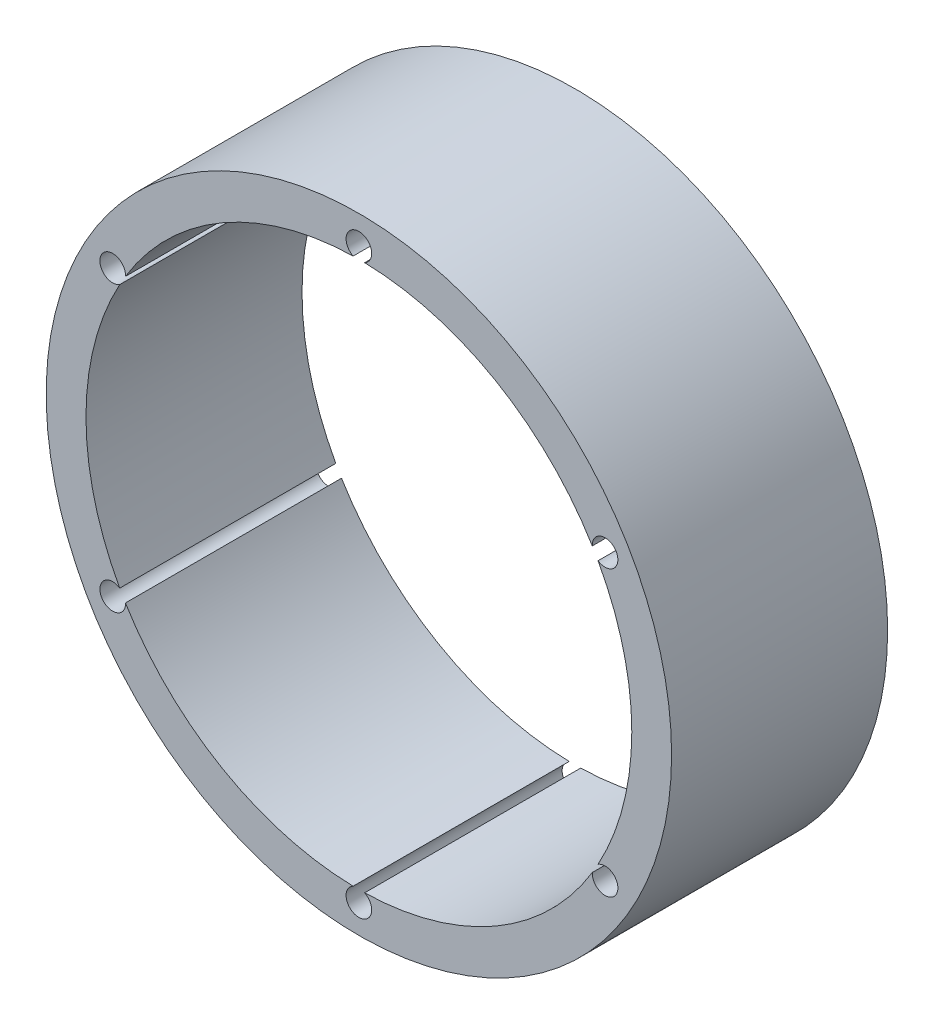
ISO-10303-21;
HEADER;
FILE_DESCRIPTION(('STEP AP214'),'2;1');
FILE_NAME('part.step','',(''),(''),'','','');
FILE_SCHEMA(('AUTOMOTIVE_DESIGN { 1 0 10303 214 1 1 1 1 }'));
ENDSEC;
DATA;
#1=APPLICATION_CONTEXT('core data for automotive mechanical design processes');
#2=APPLICATION_PROTOCOL_DEFINITION('international standard','automotive_design',2000,#1);
#3=PRODUCT_CONTEXT('',#1,'mechanical');
#4=PRODUCT('Part','Part','',(#3));
#5=PRODUCT_RELATED_PRODUCT_CATEGORY('part','',(#4));
#6=PRODUCT_DEFINITION_FORMATION('','',#4);
#7=PRODUCT_DEFINITION_CONTEXT('part definition',#1,'design');
#8=PRODUCT_DEFINITION('design','',#6,#7);
#9=PRODUCT_DEFINITION_SHAPE('','',#8);
#10=(LENGTH_UNIT() NAMED_UNIT(*) SI_UNIT(.MILLI.,.METRE.));
#11=(NAMED_UNIT(*) PLANE_ANGLE_UNIT() SI_UNIT($,.RADIAN.));
#12=(NAMED_UNIT(*) SI_UNIT($,.STERADIAN.) SOLID_ANGLE_UNIT());
#13=UNCERTAINTY_MEASURE_WITH_UNIT(LENGTH_MEASURE(1.E-05),#10,'distance_accuracy_value','');
#14=(GEOMETRIC_REPRESENTATION_CONTEXT(3) GLOBAL_UNCERTAINTY_ASSIGNED_CONTEXT((#13)) GLOBAL_UNIT_ASSIGNED_CONTEXT((#10,
#11,#12)) REPRESENTATION_CONTEXT('',''));
#15=CARTESIAN_POINT('',(0.,0.,0.));
#16=DIRECTION('',(0.,0.,1.));
#17=DIRECTION('',(1.,0.,0.));
#18=AXIS2_PLACEMENT_3D('',#15,#16,#17);
#19=CARTESIAN_POINT('',(0.,0.,0.));
#20=DIRECTION('',(0.,0.,1.));
#21=DIRECTION('',(1.,0.,0.));
#22=AXIS2_PLACEMENT_3D('',#19,#20,#21);
#23=PLANE('',#22);
#24=CARTESIAN_POINT('',(2.625132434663E-13,0.,0.));
#25=DIRECTION('',(0.,0.,1.));
#26=DIRECTION('',(1.,0.,0.));
#27=AXIS2_PLACEMENT_3D('',#24,#25,#26);
#28=CIRCLE('',#27,48.);
#29=CARTESIAN_POINT('',(41.055070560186,24.869281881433,0.));
#30=VERTEX_POINT('',#29);
#31=CARTESIAN_POINT('',(1.009894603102,47.989375,0.));
#32=VERTEX_POINT('',#31);
#33=EDGE_CURVE('E199',#30,#32,#28,.T.);
#34=ORIENTED_EDGE('',*,*,#33,.T.);
#35=CARTESIAN_POINT('',(0.,50.,0.));
#36=DIRECTION('',(0.,0.,1.));
#37=DIRECTION('',(0.448842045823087,-0.893611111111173,0.));
#38=AXIS2_PLACEMENT_3D('',#35,#36,#37);
#39=CIRCLE('',#38,2.25);
#40=CARTESIAN_POINT('',(-1.009894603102,47.989375,0.));
#41=VERTEX_POINT('',#40);
#42=EDGE_CURVE('E245',#32,#41,#39,.T.);
#43=ORIENTED_EDGE('',*,*,#42,.T.);
#44=CARTESIAN_POINT('',(2.625132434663E-13,0.,0.));
#45=DIRECTION('',(0.,0.,1.));
#46=DIRECTION('',(1.,0.,0.));
#47=AXIS2_PLACEMENT_3D('',#44,#45,#46);
#48=CIRCLE('',#47,48.);
#49=CARTESIAN_POINT('',(-41.05507056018,24.869281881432,0.));
#50=VERTEX_POINT('',#49);
#51=EDGE_CURVE('E244',#41,#50,#48,.T.);
#52=ORIENTED_EDGE('',*,*,#51,.T.);
#53=CARTESIAN_POINT('',(-43.30127018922,25.,0.));
#54=DIRECTION('',(0.,0.,1.));
#55=DIRECTION('',(0.998310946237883,-0.0580969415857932,0.));
#56=AXIS2_PLACEMENT_3D('',#53,#54,#55);
#57=CIRCLE('',#56,2.25);
#58=CARTESIAN_POINT('',(-42.06496516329,23.120093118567,0.));
#59=VERTEX_POINT('',#58);
#60=EDGE_CURVE('E255',#50,#59,#57,.T.);
#61=ORIENTED_EDGE('',*,*,#60,.T.);
#62=CARTESIAN_POINT('',(2.625132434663E-13,0.,0.));
#63=DIRECTION('',(0.,0.,1.));
#64=DIRECTION('',(1.,0.,0.));
#65=AXIS2_PLACEMENT_3D('',#62,#63,#64);
#66=CIRCLE('',#65,48.);
#67=CARTESIAN_POINT('',(-42.06496516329,-23.12009311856,0.));
#68=VERTEX_POINT('',#67);
#69=EDGE_CURVE('E256',#59,#68,#66,.T.);
#70=ORIENTED_EDGE('',*,*,#69,.T.);
#71=CARTESIAN_POINT('',(-43.30127018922,-25.,0.));
#72=DIRECTION('',(0.,0.,1.));
#73=DIRECTION('',(0.549468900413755,0.835514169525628,0.));
#74=AXIS2_PLACEMENT_3D('',#71,#72,#73);
#75=CIRCLE('',#74,2.25);
#76=CARTESIAN_POINT('',(-41.05507056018,-24.86928188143,0.));
#77=VERTEX_POINT('',#76);
#78=EDGE_CURVE('E106',#68,#77,#75,.T.);
#79=ORIENTED_EDGE('',*,*,#78,.T.);
#80=CARTESIAN_POINT('',(2.625132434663E-13,0.,0.));
#81=DIRECTION('',(0.,0.,1.));
#82=DIRECTION('',(1.,0.,0.));
#83=AXIS2_PLACEMENT_3D('',#80,#81,#82);
#84=CIRCLE('',#83,48.);
#85=CARTESIAN_POINT('',(-1.009894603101,-47.989375,0.));
#86=VERTEX_POINT('',#85);
#87=EDGE_CURVE('E105',#77,#86,#84,.T.);
#88=ORIENTED_EDGE('',*,*,#87,.T.);
#89=CARTESIAN_POINT('',(0.,-50.,0.));
#90=DIRECTION('',(0.,0.,1.));
#91=DIRECTION('',(-0.448842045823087,0.893611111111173,0.));
#92=AXIS2_PLACEMENT_3D('',#89,#90,#91);
#93=CIRCLE('',#92,2.25);
#94=CARTESIAN_POINT('',(1.009894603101,-47.989375,0.));
#95=VERTEX_POINT('',#94);
#96=EDGE_CURVE('E87',#86,#95,#93,.T.);
#97=ORIENTED_EDGE('',*,*,#96,.T.);
#98=CARTESIAN_POINT('',(2.625132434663E-13,0.,0.));
#99=DIRECTION('',(0.,0.,1.));
#100=DIRECTION('',(1.,0.,0.));
#101=AXIS2_PLACEMENT_3D('',#98,#99,#100);
#102=CIRCLE('',#101,48.);
#103=CARTESIAN_POINT('',(41.055070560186,-24.86928188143,0.));
#104=VERTEX_POINT('',#103);
#105=EDGE_CURVE('E127',#95,#104,#102,.T.);
#106=ORIENTED_EDGE('',*,*,#105,.T.);
#107=CARTESIAN_POINT('',(43.301270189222,-25.,0.));
#108=DIRECTION('',(0.,0.,1.));
#109=DIRECTION('',(-0.998310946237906,0.0580969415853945,0.));
#110=AXIS2_PLACEMENT_3D('',#107,#108,#109);
#111=CIRCLE('',#110,2.25);
#112=CARTESIAN_POINT('',(42.064965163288,-23.12009311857,0.));
#113=VERTEX_POINT('',#112);
#114=EDGE_CURVE('E25',#104,#113,#111,.T.);
#115=ORIENTED_EDGE('',*,*,#114,.T.);
#116=CARTESIAN_POINT('',(2.625132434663E-13,0.,0.));
#117=DIRECTION('',(0.,0.,1.));
#118=DIRECTION('',(0.876353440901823,-0.481668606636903,0.));
#119=AXIS2_PLACEMENT_3D('',#116,#117,#118);
#120=CIRCLE('',#119,48.);
#121=CARTESIAN_POINT('',(42.064965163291,23.120093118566,0.));
#122=VERTEX_POINT('',#121);
#123=EDGE_CURVE('E10',#113,#122,#120,.T.);
#124=ORIENTED_EDGE('',*,*,#123,.T.);
#125=CARTESIAN_POINT('',(43.301270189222,25.,0.));
#126=DIRECTION('',(0.,0.,1.));
#127=DIRECTION('',(-0.549468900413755,-0.835514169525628,0.));
#128=AXIS2_PLACEMENT_3D('',#125,#126,#127);
#129=CIRCLE('',#128,2.25);
#130=EDGE_CURVE('E210',#122,#30,#129,.T.);
#131=ORIENTED_EDGE('',*,*,#130,.T.);
#132=EDGE_LOOP('',(#34,#43,#52,#61,#70,#79,#88,#97,#106,#115,#124,#131));
#133=FACE_BOUND('',#132,.T.);
#134=CARTESIAN_POINT('',(0.,0.,0.));
#135=DIRECTION('',(0.,0.,1.));
#136=DIRECTION('',(1.,0.,0.));
#137=AXIS2_PLACEMENT_3D('',#134,#135,#136);
#138=CIRCLE('',#137,55.);
#139=CARTESIAN_POINT('',(55.,0.,0.));
#140=VERTEX_POINT('',#139);
#141=EDGE_CURVE('E325',#140,#140,#138,.T.);
#142=ORIENTED_EDGE('',*,*,#141,.F.);
#143=EDGE_LOOP('',(#142));
#144=FACE_BOUND('',#143,.T.);
#145=ADVANCED_FACE('F16',(#133,#144),#23,.F.);
#146=CARTESIAN_POINT('',(2.625132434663E-13,0.,0.));
#147=DIRECTION('',(0.,0.,-1.));
#148=DIRECTION('',(1.,0.,0.));
#149=AXIS2_PLACEMENT_3D('',#146,#147,#148);
#150=CYLINDRICAL_SURFACE('',#149,48.);
#151=ORIENTED_EDGE('',*,*,#123,.F.);
#152=DIRECTION('',(0.,0.,-1.));
#153=VECTOR('',#152,1.);
#154=CARTESIAN_POINT('',(42.064965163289,-23.12009311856,0.));
#155=LINE('',#154,#153);
#156=CARTESIAN_POINT('',(42.064965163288,-23.12009311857,38.));
#157=VERTEX_POINT('',#156);
#158=EDGE_CURVE('E135',#157,#113,#155,.T.);
#159=ORIENTED_EDGE('',*,*,#158,.F.);
#160=CARTESIAN_POINT('',(2.625132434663E-13,0.,38.));
#161=DIRECTION('',(0.,0.,-1.));
#162=DIRECTION('',(0.876353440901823,0.481668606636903,0.));
#163=AXIS2_PLACEMENT_3D('',#160,#161,#162);
#164=CIRCLE('',#163,48.);
#165=CARTESIAN_POINT('',(42.064965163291,23.120093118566,38.));
#166=VERTEX_POINT('',#165);
#167=EDGE_CURVE('E144',#166,#157,#164,.T.);
#168=ORIENTED_EDGE('',*,*,#167,.F.);
#169=DIRECTION('',(0.,0.,-1.));
#170=VECTOR('',#169,1.);
#171=CARTESIAN_POINT('',(42.064965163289,23.120093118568,0.));
#172=LINE('',#171,#170);
#173=EDGE_CURVE('E204',#166,#122,#172,.T.);
#174=ORIENTED_EDGE('',*,*,#173,.T.);
#175=EDGE_LOOP('',(#151,#159,#168,#174));
#176=FACE_BOUND('',#175,.T.);
#177=ADVANCED_FACE('F141',(#176),#150,.F.);
#178=CARTESIAN_POINT('',(43.301270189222,-25.,0.));
#179=DIRECTION('',(0.,0.,-1.));
#180=DIRECTION('',(1.,0.,0.));
#181=AXIS2_PLACEMENT_3D('',#178,#179,#180);
#182=CYLINDRICAL_SURFACE('',#181,2.25);
#183=CARTESIAN_POINT('',(43.301270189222,-25.,38.));
#184=DIRECTION('',(0.,0.,-1.));
#185=DIRECTION('',(-0.549468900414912,0.835514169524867,0.));
#186=AXIS2_PLACEMENT_3D('',#183,#184,#185);
#187=CIRCLE('',#186,2.25);
#188=CARTESIAN_POINT('',(41.055070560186,-24.86928188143,38.));
#189=VERTEX_POINT('',#188);
#190=EDGE_CURVE('E138',#157,#189,#187,.T.);
#191=ORIENTED_EDGE('',*,*,#190,.F.);
#192=ORIENTED_EDGE('',*,*,#158,.T.);
#193=ORIENTED_EDGE('',*,*,#114,.F.);
#194=DIRECTION('',(0.,0.,-1.));
#195=VECTOR('',#194,1.);
#196=CARTESIAN_POINT('',(41.055070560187,-24.86928188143,0.));
#197=LINE('',#196,#195);
#198=EDGE_CURVE('E97',#189,#104,#197,.T.);
#199=ORIENTED_EDGE('',*,*,#198,.F.);
#200=EDGE_LOOP('',(#191,#192,#193,#199));
#201=FACE_BOUND('',#200,.T.);
#202=ADVANCED_FACE('F18',(#201),#182,.F.);
#203=CARTESIAN_POINT('',(2.625132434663E-13,0.,0.));
#204=DIRECTION('',(0.,0.,-1.));
#205=DIRECTION('',(1.,0.,0.));
#206=AXIS2_PLACEMENT_3D('',#203,#204,#205);
#207=CYLINDRICAL_SURFACE('',#206,48.);
#208=ORIENTED_EDGE('',*,*,#198,.T.);
#209=ORIENTED_EDGE('',*,*,#105,.F.);
#210=DIRECTION('',(0.,0.,-1.));
#211=VECTOR('',#210,1.);
#212=CARTESIAN_POINT('',(1.009894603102,-47.989375,0.));
#213=LINE('',#212,#211);
#214=CARTESIAN_POINT('',(1.009894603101,-47.989375,38.));
#215=VERTEX_POINT('',#214);
#216=EDGE_CURVE('E96',#215,#95,#213,.T.);
#217=ORIENTED_EDGE('',*,*,#216,.F.);
#218=CARTESIAN_POINT('',(2.625132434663E-13,0.,38.));
#219=DIRECTION('',(0.,0.,1.));
#220=DIRECTION('',(1.,0.,0.));
#221=AXIS2_PLACEMENT_3D('',#218,#219,#220);
#222=CIRCLE('',#221,48.);
#223=EDGE_CURVE('E287',#215,#189,#222,.T.);
#224=ORIENTED_EDGE('',*,*,#223,.T.);
#225=EDGE_LOOP('',(#208,#209,#217,#224));
#226=FACE_BOUND('',#225,.T.);
#227=ADVANCED_FACE('F316',(#226),#207,.F.);
#228=CARTESIAN_POINT('',(0.,-50.,0.));
#229=DIRECTION('',(0.,0.,-1.));
#230=DIRECTION('',(1.,0.,0.));
#231=AXIS2_PLACEMENT_3D('',#228,#229,#230);
#232=CYLINDRICAL_SURFACE('',#231,2.25);
#233=CARTESIAN_POINT('',(0.,-50.,38.));
#234=DIRECTION('',(0.,0.,-1.));
#235=DIRECTION('',(0.448842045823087,0.893611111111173,0.));
#236=AXIS2_PLACEMENT_3D('',#233,#234,#235);
#237=CIRCLE('',#236,2.25);
#238=CARTESIAN_POINT('',(-1.009894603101,-47.989375,38.));
#239=VERTEX_POINT('',#238);
#240=EDGE_CURVE('E278',#215,#239,#237,.T.);
#241=ORIENTED_EDGE('',*,*,#240,.F.);
#242=ORIENTED_EDGE('',*,*,#216,.T.);
#243=ORIENTED_EDGE('',*,*,#96,.F.);
#244=DIRECTION('',(0.,0.,-1.));
#245=VECTOR('',#244,1.);
#246=CARTESIAN_POINT('',(-1.009894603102,-47.989375,0.));
#247=LINE('',#246,#245);
#248=EDGE_CURVE('E91',#239,#86,#247,.T.);
#249=ORIENTED_EDGE('',*,*,#248,.F.);
#250=EDGE_LOOP('',(#241,#242,#243,#249));
#251=FACE_BOUND('',#250,.T.);
#252=ADVANCED_FACE('F89',(#251),#232,.F.);
#253=CARTESIAN_POINT('',(2.625132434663E-13,0.,0.));
#254=DIRECTION('',(0.,0.,-1.));
#255=DIRECTION('',(1.,0.,0.));
#256=AXIS2_PLACEMENT_3D('',#253,#254,#255);
#257=CYLINDRICAL_SURFACE('',#256,48.);
#258=ORIENTED_EDGE('',*,*,#248,.T.);
#259=ORIENTED_EDGE('',*,*,#87,.F.);
#260=DIRECTION('',(0.,0.,-1.));
#261=VECTOR('',#260,1.);
#262=CARTESIAN_POINT('',(-41.05507056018,-24.86928188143,0.));
#263=LINE('',#262,#261);
#264=CARTESIAN_POINT('',(-41.05507056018,-24.86928188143,38.));
#265=VERTEX_POINT('',#264);
#266=EDGE_CURVE('E120',#265,#77,#263,.T.);
#267=ORIENTED_EDGE('',*,*,#266,.F.);
#268=CARTESIAN_POINT('',(2.625132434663E-13,0.,38.));
#269=DIRECTION('',(0.,0.,1.));
#270=DIRECTION('',(1.,0.,0.));
#271=AXIS2_PLACEMENT_3D('',#268,#269,#270);
#272=CIRCLE('',#271,48.);
#273=EDGE_CURVE('E111',#265,#239,#272,.T.);
#274=ORIENTED_EDGE('',*,*,#273,.T.);
#275=EDGE_LOOP('',(#258,#259,#267,#274));
#276=FACE_BOUND('',#275,.T.);
#277=ADVANCED_FACE('F115',(#276),#257,.F.);
#278=CARTESIAN_POINT('',(-43.30127018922,-25.,0.));
#279=DIRECTION('',(0.,0.,-1.));
#280=DIRECTION('',(1.,0.,0.));
#281=AXIS2_PLACEMENT_3D('',#278,#279,#280);
#282=CYLINDRICAL_SURFACE('',#281,2.25);
#283=CARTESIAN_POINT('',(-43.30127018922,-25.,38.));
#284=DIRECTION('',(0.,0.,-1.));
#285=DIRECTION('',(0.998310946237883,0.0580969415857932,0.));
#286=AXIS2_PLACEMENT_3D('',#283,#284,#285);
#287=CIRCLE('',#286,2.25);
#288=CARTESIAN_POINT('',(-42.06496516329,-23.12009311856,38.));
#289=VERTEX_POINT('',#288);
#290=EDGE_CURVE('E269',#265,#289,#287,.T.);
#291=ORIENTED_EDGE('',*,*,#290,.F.);
#292=ORIENTED_EDGE('',*,*,#266,.T.);
#293=ORIENTED_EDGE('',*,*,#78,.F.);
#294=DIRECTION('',(0.,0.,-1.));
#295=VECTOR('',#294,1.);
#296=CARTESIAN_POINT('',(-42.06496516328,-23.12009311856,0.));
#297=LINE('',#296,#295);
#298=EDGE_CURVE('E261',#289,#68,#297,.T.);
#299=ORIENTED_EDGE('',*,*,#298,.F.);
#300=EDGE_LOOP('',(#291,#292,#293,#299));
#301=FACE_BOUND('',#300,.T.);
#302=ADVANCED_FACE('F268',(#301),#282,.F.);
#303=CARTESIAN_POINT('',(2.625132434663E-13,0.,0.));
#304=DIRECTION('',(0.,0.,-1.));
#305=DIRECTION('',(1.,0.,0.));
#306=AXIS2_PLACEMENT_3D('',#303,#304,#305);
#307=CYLINDRICAL_SURFACE('',#306,48.);
#308=ORIENTED_EDGE('',*,*,#69,.F.);
#309=DIRECTION('',(0.,0.,-1.));
#310=VECTOR('',#309,1.);
#311=CARTESIAN_POINT('',(-42.06496516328,23.120093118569,0.));
#312=LINE('',#311,#310);
#313=CARTESIAN_POINT('',(-42.06496516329,23.120093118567,38.));
#314=VERTEX_POINT('',#313);
#315=EDGE_CURVE('E251',#314,#59,#312,.T.);
#316=ORIENTED_EDGE('',*,*,#315,.F.);
#317=CARTESIAN_POINT('',(2.625132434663E-13,0.,38.));
#318=DIRECTION('',(0.,0.,1.));
#319=DIRECTION('',(1.,0.,0.));
#320=AXIS2_PLACEMENT_3D('',#317,#318,#319);
#321=CIRCLE('',#320,48.);
#322=EDGE_CURVE('E274',#314,#289,#321,.T.);
#323=ORIENTED_EDGE('',*,*,#322,.T.);
#324=ORIENTED_EDGE('',*,*,#298,.T.);
#325=EDGE_LOOP('',(#308,#316,#323,#324));
#326=FACE_BOUND('',#325,.T.);
#327=ADVANCED_FACE('F341',(#326),#307,.F.);
#328=CARTESIAN_POINT('',(-43.30127018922,25.,0.));
#329=DIRECTION('',(0.,0.,-1.));
#330=DIRECTION('',(1.,0.,0.));
#331=AXIS2_PLACEMENT_3D('',#328,#329,#330);
#332=CYLINDRICAL_SURFACE('',#331,2.25);
#333=CARTESIAN_POINT('',(-43.30127018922,25.,38.));
#334=DIRECTION('',(0.,0.,-1.));
#335=DIRECTION('',(0.549468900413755,-0.835514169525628,0.));
#336=AXIS2_PLACEMENT_3D('',#333,#334,#335);
#337=CIRCLE('',#336,2.25);
#338=CARTESIAN_POINT('',(-41.05507056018,24.869281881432,38.));
#339=VERTEX_POINT('',#338);
#340=EDGE_CURVE('E223',#314,#339,#337,.T.);
#341=ORIENTED_EDGE('',*,*,#340,.F.);
#342=ORIENTED_EDGE('',*,*,#315,.T.);
#343=ORIENTED_EDGE('',*,*,#60,.F.);
#344=DIRECTION('',(0.,0.,-1.));
#345=VECTOR('',#344,1.);
#346=CARTESIAN_POINT('',(-41.05507056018,24.869281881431,0.));
#347=LINE('',#346,#345);
#348=EDGE_CURVE('E246',#339,#50,#347,.T.);
#349=ORIENTED_EDGE('',*,*,#348,.F.);
#350=EDGE_LOOP('',(#341,#342,#343,#349));
#351=FACE_BOUND('',#350,.T.);
#352=ADVANCED_FACE('F297',(#351),#332,.F.);
#353=CARTESIAN_POINT('',(2.625132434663E-13,0.,0.));
#354=DIRECTION('',(0.,0.,-1.));
#355=DIRECTION('',(1.,0.,0.));
#356=AXIS2_PLACEMENT_3D('',#353,#354,#355);
#357=CYLINDRICAL_SURFACE('',#356,48.);
#358=ORIENTED_EDGE('',*,*,#51,.F.);
#359=DIRECTION('',(0.,0.,-1.));
#360=VECTOR('',#359,1.);
#361=CARTESIAN_POINT('',(-1.009894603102,47.989375,0.));
#362=LINE('',#361,#360);
#363=CARTESIAN_POINT('',(-1.009894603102,47.989375,38.));
#364=VERTEX_POINT('',#363);
#365=EDGE_CURVE('E238',#364,#41,#362,.T.);
#366=ORIENTED_EDGE('',*,*,#365,.F.);
#367=CARTESIAN_POINT('',(2.625132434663E-13,0.,38.));
#368=DIRECTION('',(0.,0.,1.));
#369=DIRECTION('',(1.,0.,0.));
#370=AXIS2_PLACEMENT_3D('',#367,#368,#369);
#371=CIRCLE('',#370,48.);
#372=EDGE_CURVE('E227',#364,#339,#371,.T.);
#373=ORIENTED_EDGE('',*,*,#372,.T.);
#374=ORIENTED_EDGE('',*,*,#348,.T.);
#375=EDGE_LOOP('',(#358,#366,#373,#374));
#376=FACE_BOUND('',#375,.T.);
#377=ADVANCED_FACE('F299',(#376),#357,.F.);
#378=CARTESIAN_POINT('',(0.,50.,0.));
#379=DIRECTION('',(0.,0.,-1.));
#380=DIRECTION('',(1.,0.,0.));
#381=AXIS2_PLACEMENT_3D('',#378,#379,#380);
#382=CYLINDRICAL_SURFACE('',#381,2.25);
#383=CARTESIAN_POINT('',(0.,50.,38.));
#384=DIRECTION('',(0.,0.,-1.));
#385=DIRECTION('',(-0.448842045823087,-0.893611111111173,0.));
#386=AXIS2_PLACEMENT_3D('',#383,#384,#385);
#387=CIRCLE('',#386,2.25);
#388=CARTESIAN_POINT('',(1.009894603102,47.989375,38.));
#389=VERTEX_POINT('',#388);
#390=EDGE_CURVE('E230',#364,#389,#387,.T.);
#391=ORIENTED_EDGE('',*,*,#390,.F.);
#392=ORIENTED_EDGE('',*,*,#365,.T.);
#393=ORIENTED_EDGE('',*,*,#42,.F.);
#394=DIRECTION('',(0.,0.,-1.));
#395=VECTOR('',#394,1.);
#396=CARTESIAN_POINT('',(1.009894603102,47.989375,0.));
#397=LINE('',#396,#395);
#398=EDGE_CURVE('E187',#389,#32,#397,.T.);
#399=ORIENTED_EDGE('',*,*,#398,.F.);
#400=EDGE_LOOP('',(#391,#392,#393,#399));
#401=FACE_BOUND('',#400,.T.);
#402=ADVANCED_FACE('F302',(#401),#382,.F.);
#403=CARTESIAN_POINT('',(2.625132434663E-13,0.,0.));
#404=DIRECTION('',(0.,0.,-1.));
#405=DIRECTION('',(1.,0.,0.));
#406=AXIS2_PLACEMENT_3D('',#403,#404,#405);
#407=CYLINDRICAL_SURFACE('',#406,48.);
#408=ORIENTED_EDGE('',*,*,#33,.F.);
#409=DIRECTION('',(0.,0.,-1.));
#410=VECTOR('',#409,1.);
#411=CARTESIAN_POINT('',(41.055070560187,24.869281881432,0.));
#412=LINE('',#411,#410);
#413=CARTESIAN_POINT('',(41.055070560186,24.869281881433,38.));
#414=VERTEX_POINT('',#413);
#415=EDGE_CURVE('E197',#414,#30,#412,.T.);
#416=ORIENTED_EDGE('',*,*,#415,.F.);
#417=CARTESIAN_POINT('',(2.625132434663E-13,0.,38.));
#418=DIRECTION('',(0.,0.,1.));
#419=DIRECTION('',(1.,0.,0.));
#420=AXIS2_PLACEMENT_3D('',#417,#418,#419);
#421=CIRCLE('',#420,48.);
#422=EDGE_CURVE('E222',#414,#389,#421,.T.);
#423=ORIENTED_EDGE('',*,*,#422,.T.);
#424=ORIENTED_EDGE('',*,*,#398,.T.);
#425=EDGE_LOOP('',(#408,#416,#423,#424));
#426=FACE_BOUND('',#425,.T.);
#427=ADVANCED_FACE('F203',(#426),#407,.F.);
#428=CARTESIAN_POINT('',(43.301270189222,25.,0.));
#429=DIRECTION('',(0.,0.,-1.));
#430=DIRECTION('',(1.,0.,0.));
#431=AXIS2_PLACEMENT_3D('',#428,#429,#430);
#432=CYLINDRICAL_SURFACE('',#431,2.25);
#433=CARTESIAN_POINT('',(43.301270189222,25.,38.));
#434=DIRECTION('',(0.,0.,-1.));
#435=DIRECTION('',(-0.998310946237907,-0.0580969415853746,0.));
#436=AXIS2_PLACEMENT_3D('',#433,#434,#435);
#437=CIRCLE('',#436,2.25);
#438=EDGE_CURVE('E213',#414,#166,#437,.T.);
#439=ORIENTED_EDGE('',*,*,#438,.F.);
#440=ORIENTED_EDGE('',*,*,#415,.T.);
#441=ORIENTED_EDGE('',*,*,#130,.F.);
#442=ORIENTED_EDGE('',*,*,#173,.F.);
#443=EDGE_LOOP('',(#439,#440,#441,#442));
#444=FACE_BOUND('',#443,.T.);
#445=ADVANCED_FACE('F211',(#444),#432,.F.);
#446=CARTESIAN_POINT('',(0.,0.,38.));
#447=DIRECTION('',(0.,0.,1.));
#448=DIRECTION('',(1.,0.,0.));
#449=AXIS2_PLACEMENT_3D('',#446,#447,#448);
#450=PLANE('',#449);
#451=ORIENTED_EDGE('',*,*,#167,.T.);
#452=ORIENTED_EDGE('',*,*,#190,.T.);
#453=ORIENTED_EDGE('',*,*,#223,.F.);
#454=ORIENTED_EDGE('',*,*,#240,.T.);
#455=ORIENTED_EDGE('',*,*,#273,.F.);
#456=ORIENTED_EDGE('',*,*,#290,.T.);
#457=ORIENTED_EDGE('',*,*,#322,.F.);
#458=ORIENTED_EDGE('',*,*,#340,.T.);
#459=ORIENTED_EDGE('',*,*,#372,.F.);
#460=ORIENTED_EDGE('',*,*,#390,.T.);
#461=ORIENTED_EDGE('',*,*,#422,.F.);
#462=ORIENTED_EDGE('',*,*,#438,.T.);
#463=EDGE_LOOP('',(#451,#452,#453,#454,#455,#456,#457,#458,#459,#460,#461,#462));
#464=FACE_BOUND('',#463,.T.);
#465=CARTESIAN_POINT('',(0.,0.,38.));
#466=DIRECTION('',(0.,0.,1.));
#467=DIRECTION('',(1.,0.,0.));
#468=AXIS2_PLACEMENT_3D('',#465,#466,#467);
#469=CIRCLE('',#468,55.);
#470=CARTESIAN_POINT('',(55.,0.,38.));
#471=VERTEX_POINT('',#470);
#472=EDGE_CURVE('E310',#471,#471,#469,.T.);
#473=ORIENTED_EDGE('',*,*,#472,.T.);
#474=EDGE_LOOP('',(#473));
#475=FACE_BOUND('',#474,.T.);
#476=ADVANCED_FACE('F280',(#464,#475),#450,.T.);
#477=CARTESIAN_POINT('',(0.,0.,0.));
#478=DIRECTION('',(0.,0.,-1.));
#479=DIRECTION('',(1.,0.,0.));
#480=AXIS2_PLACEMENT_3D('',#477,#478,#479);
#481=CYLINDRICAL_SURFACE('',#480,55.);
#482=ORIENTED_EDGE('',*,*,#472,.F.);
#483=EDGE_LOOP('',(#482));
#484=FACE_BOUND('',#483,.T.);
#485=ORIENTED_EDGE('',*,*,#141,.T.);
#486=EDGE_LOOP('',(#485));
#487=FACE_BOUND('',#486,.T.);
#488=ADVANCED_FACE('F330',(#484,#487),#481,.T.);
#489=CLOSED_SHELL('',(#145,#177,#202,#227,#252,#277,#302,#327,#352,#377,#402,#427,#445,#476,#488));
#490=MANIFOLD_SOLID_BREP('B1',#489);
#491=ADVANCED_BREP_SHAPE_REPRESENTATION('',(#18,#490),#14);
#492=SHAPE_DEFINITION_REPRESENTATION(#9,#491);
ENDSEC;
END-ISO-10303-21;
